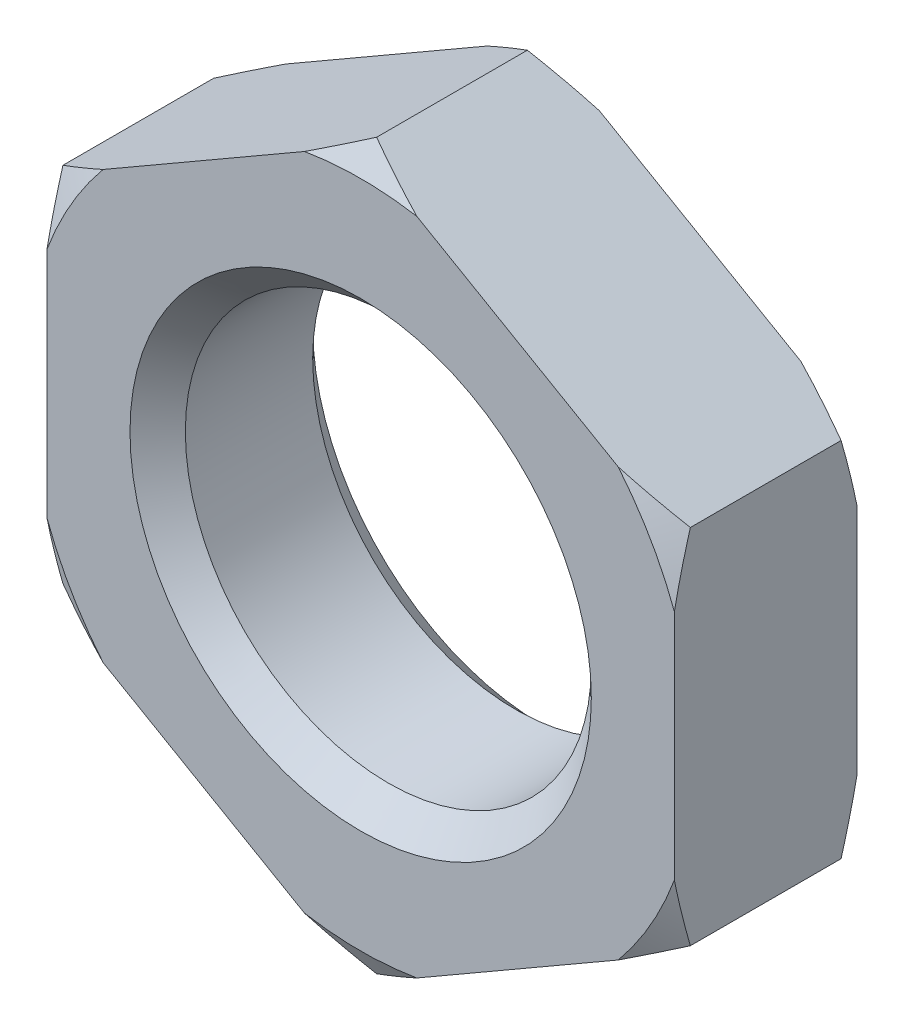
from build123d import *

# Parameters (mm, degrees)
SKETCH1_R           = 11
BOSS_EXTRUDE1_DEPTH = 4.95
CHAMFER1_SIZE       = 1.5


with BuildPart() as part:
    # Sketch1 → Boss-Extrude1 (new, symmetric)
    with BuildSketch(Plane.XY):
        Polygon((0, 19.629909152), (-17, 9.814954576), (-17, -9.814954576), (0, -19.629909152), (17, -9.814954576), (17, 9.814954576), align=None)
        with Locations(Location((0, 0, 0), (0, 0, 180))):
            Circle(SKETCH1_R, mode=Mode.SUBTRACT)
    extrude(amount=BOSS_EXTRUDE1_DEPTH, both=True)

    # Sketch3 → Cut-Revolve1 (revolve, cut)
    with BuildSketch(Plane(origin=(0, 0, 0), x_dir=(0, 0, -1), z_dir=(1, 0, 0))):
        Polygon((-4.95, 19.629909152), (-4.95, 18.129909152), (-4.083974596, 19.629909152), align=None)
    cut_revolve1 = revolve(axis=Axis((0, 0, -7.477018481), (0, 0, 1)), mode=Mode.SUBTRACT)

    # Mirror1: Cut-Revolve1 across plane
    add(cut_revolve1.mirror(Plane.XY), mode=Mode.SUBTRACT)

    # Chamfer1
    chamfer1_edges = [part.edges().sort_by_distance(p)[0] for p in [
        (11, 0, -4.95),
        (11, 0, 4.95),
    ]]
    chamfer(chamfer1_edges, length=CHAMFER1_SIZE)


solid = part.part
